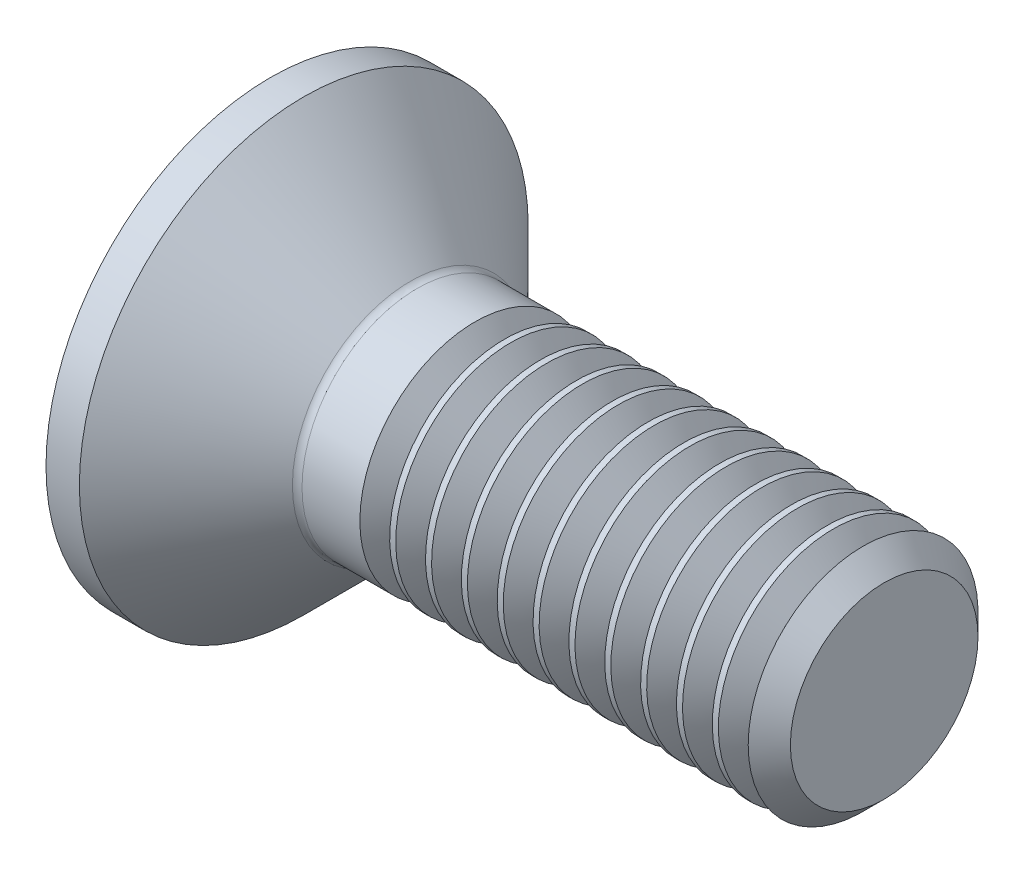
from build123d import *

# Parameters (mm, degrees)
FILLET1_R       = 0.25
HEX_2_DEPTH     = 2.2
THDSCHPAT_COUNT = 11
THDSCHPAT_PITCH = 0.934545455


with BuildPart() as part:
    # BodySke → BaseBody (revolve)
    with BuildSketch(Plane.XY, mode=Mode.PRIVATE) as basebody_sk:
        Polygon((0, 0), (0, 5.85), (0.87, 5.85), (3.72, 3), (15.4455, 3), (16, 2.4455), (16, 0), align=None)
    revolve(basebody_sk.sketch.rotate(Axis((0, 0, 0), (1, 0, 0)), 90), axis=Axis((0, 0, 0), (1, 0, 0)))

    # Fillet1
    fillet1_edges = [part.edges().sort_by_distance(p)[0] for p in [
        (3.72, 0, -3),
    ]]
    fillet(fillet1_edges, radius=FILLET1_R)

    # Sketch2 → PreBroach (revolve, cut)
    with BuildSketch(Plane.XY, mode=Mode.PRIVATE) as prebroach_sk:
        Polygon((0, 2), (2.2, 2), (3.354700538, 0), (0, 0), align=None)
    revolve(prebroach_sk.sketch.rotate(Axis((0, 0, 0), (1, 0, 0)), 90), axis=Axis((0, 0, 0), (1, 0, 0)), mode=Mode.SUBTRACT)

    # Sketch3 → Hex 2 (cut)
    with BuildSketch(Plane.ZY):
        Polygon((-2, -1.154700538), (-2, 1.154700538), (0, 2.309401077), (2, 1.154700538), (2, -1.154700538), (0, -2.309401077), align=None)
    extrude(amount=-HEX_2_DEPTH, mode=Mode.SUBTRACT)

    # ThdSchSke → ThreadSchematic (revolve, cut)
    with BuildSketch(Plane.XY, mode=Mode.PRIVATE) as threadschematic_sk:
        Polygon((5.720001, -2.4455), (5.33173592, -3), (5.33173592, -3.75), (6.10826608, -3.75), (6.10826608, -3), align=None)
    threadschematic = revolve(threadschematic_sk.sketch.rotate(Axis((-3.175, 0, 0), (1, 0, 0)), 270), axis=Axis((-3.175, 0, 0), (1, 0, 0)), mode=Mode.SUBTRACT)

    # ThdSchPat: ThreadSchematic ×11
    with Locations(*[(i * THDSCHPAT_PITCH, 0, 0) for i in range(1, THDSCHPAT_COUNT)]):
        add(threadschematic, mode=Mode.SUBTRACT)


solid = part.part
